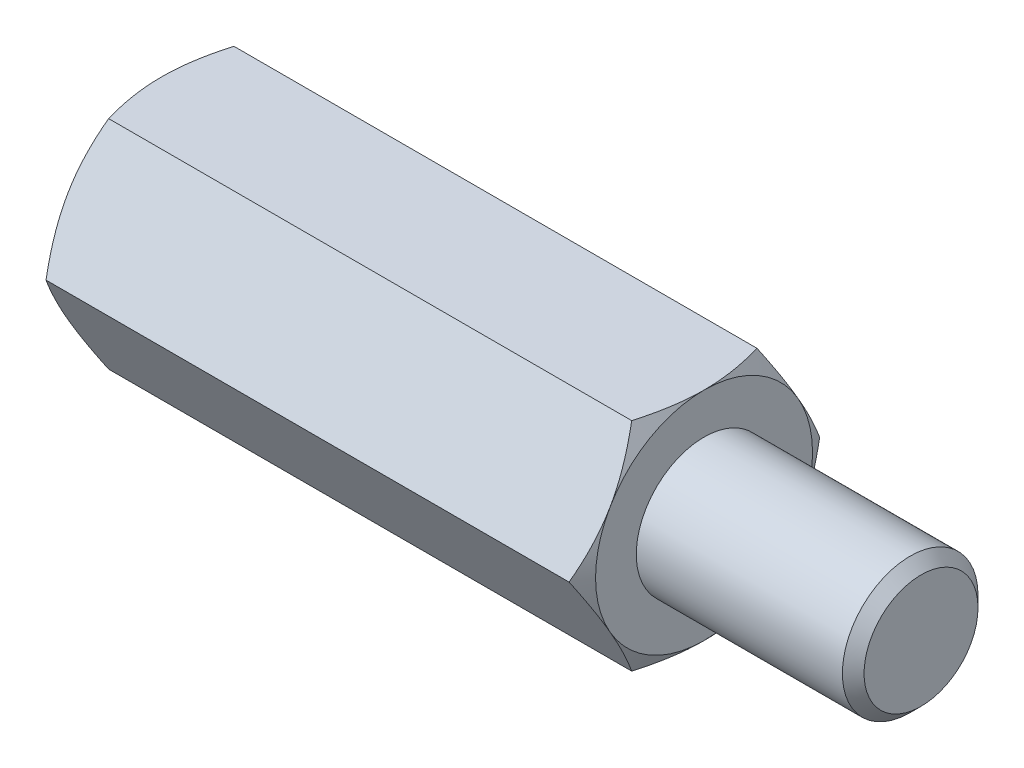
ISO-10303-21;
HEADER;
FILE_DESCRIPTION(('STEP AP214'),'2;1');
FILE_NAME('part.step','',(''),(''),'','','');
FILE_SCHEMA(('AUTOMOTIVE_DESIGN { 1 0 10303 214 1 1 1 1 }'));
ENDSEC;
DATA;
#1=APPLICATION_CONTEXT('core data for automotive mechanical design processes');
#2=APPLICATION_PROTOCOL_DEFINITION('international standard','automotive_design',2000,#1);
#3=PRODUCT_CONTEXT('',#1,'mechanical');
#4=PRODUCT('Part','Part','',(#3));
#5=PRODUCT_RELATED_PRODUCT_CATEGORY('part','',(#4));
#6=PRODUCT_DEFINITION_FORMATION('','',#4);
#7=PRODUCT_DEFINITION_CONTEXT('part definition',#1,'design');
#8=PRODUCT_DEFINITION('design','',#6,#7);
#9=PRODUCT_DEFINITION_SHAPE('','',#8);
#10=(LENGTH_UNIT() NAMED_UNIT(*) SI_UNIT(.MILLI.,.METRE.));
#11=(NAMED_UNIT(*) PLANE_ANGLE_UNIT() SI_UNIT($,.RADIAN.));
#12=(NAMED_UNIT(*) SI_UNIT($,.STERADIAN.) SOLID_ANGLE_UNIT());
#13=UNCERTAINTY_MEASURE_WITH_UNIT(LENGTH_MEASURE(1.E-05),#10,'distance_accuracy_value','');
#14=(GEOMETRIC_REPRESENTATION_CONTEXT(3) GLOBAL_UNCERTAINTY_ASSIGNED_CONTEXT((#13)) GLOBAL_UNIT_ASSIGNED_CONTEXT((#10,
#11,#12)) REPRESENTATION_CONTEXT('',''));
#15=CARTESIAN_POINT('',(0.,0.,0.));
#16=DIRECTION('',(0.,0.,1.));
#17=DIRECTION('',(1.,0.,0.));
#18=AXIS2_PLACEMENT_3D('',#15,#16,#17);
#19=CARTESIAN_POINT('',(10.,4.,-2.3094010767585));
#20=DIRECTION('',(1.,0.,0.));
#21=DIRECTION('',(0.,0.,-1.));
#22=AXIS2_PLACEMENT_3D('',#19,#20,#21);
#23=PLANE('',#22);
#24=CARTESIAN_POINT('',(10.,0.,0.));
#25=DIRECTION('',(1.,0.,0.));
#26=DIRECTION('',(0.,0.,-1.));
#27=AXIS2_PLACEMENT_3D('',#24,#25,#26);
#28=CIRCLE('',#27,4.);
#29=CARTESIAN_POINT('',(10.,-2.,-3.46410161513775));
#30=VERTEX_POINT('',#29);
#31=CARTESIAN_POINT('',(10.,2.,-3.46410161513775));
#32=VERTEX_POINT('',#31);
#33=EDGE_CURVE('E288',#30,#32,#28,.T.);
#34=ORIENTED_EDGE('',*,*,#33,.T.);
#35=CARTESIAN_POINT('',(10.,4.,0.));
#36=VERTEX_POINT('',#35);
#37=EDGE_CURVE('E53',#32,#36,#28,.T.);
#38=ORIENTED_EDGE('',*,*,#37,.T.);
#39=CARTESIAN_POINT('',(10.,2.,3.46410161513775));
#40=VERTEX_POINT('',#39);
#41=EDGE_CURVE('E297',#36,#40,#28,.T.);
#42=ORIENTED_EDGE('',*,*,#41,.T.);
#43=CARTESIAN_POINT('',(10.,-2.,3.46410161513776));
#44=VERTEX_POINT('',#43);
#45=EDGE_CURVE('E301',#40,#44,#28,.T.);
#46=ORIENTED_EDGE('',*,*,#45,.T.);
#47=CARTESIAN_POINT('',(10.,0.,0.));
#48=DIRECTION('',(-1.,0.,0.));
#49=DIRECTION('',(0.,-1.,0.));
#50=AXIS2_PLACEMENT_3D('',#47,#48,#49);
#51=CIRCLE('',#50,4.);
#52=CARTESIAN_POINT('',(10.,-4.,0.));
#53=VERTEX_POINT('',#52);
#54=EDGE_CURVE('E193',#53,#44,#51,.T.);
#55=ORIENTED_EDGE('',*,*,#54,.F.);
#56=EDGE_CURVE('E61',#53,#30,#28,.T.);
#57=ORIENTED_EDGE('',*,*,#56,.T.);
#58=EDGE_LOOP('',(#34,#38,#42,#46,#55,#57));
#59=FACE_BOUND('',#58,.T.);
#60=CARTESIAN_POINT('',(10.,0.,0.));
#61=DIRECTION('',(1.,0.,0.));
#62=DIRECTION('',(0.,0.,-1.));
#63=AXIS2_PLACEMENT_3D('',#60,#61,#62);
#64=CIRCLE('',#63,2.5);
#65=CARTESIAN_POINT('',(10.,0.,-2.5));
#66=VERTEX_POINT('',#65);
#67=EDGE_CURVE('E310',#66,#66,#64,.T.);
#68=ORIENTED_EDGE('',*,*,#67,.F.);
#69=EDGE_LOOP('',(#68));
#70=FACE_BOUND('',#69,.T.);
#71=ADVANCED_FACE('F37',(#59,#70),#23,.T.);
#72=CARTESIAN_POINT('',(10.,0.,-4.61880215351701));
#73=DIRECTION('',(0.,-0.5,0.866025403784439));
#74=DIRECTION('',(0.,-0.866025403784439,-0.5));
#75=AXIS2_PLACEMENT_3D('',#72,#73,#74);
#76=PLANE('',#75);
#77=CARTESIAN_POINT('',(9.64266774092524,-0.000200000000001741,-4.61891762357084));
#78=CARTESIAN_POINT('',(9.70128212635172,0.175579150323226,-4.5174314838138));
#79=CARTESIAN_POINT('',(9.75458967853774,0.352875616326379,-4.41506932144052));
#80=CARTESIAN_POINT('',(9.8476383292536,0.710538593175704,-4.2085725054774));
#81=CARTESIAN_POINT('',(9.8873465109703,0.890911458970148,-4.10443418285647));
#82=CARTESIAN_POINT('',(9.94915778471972,1.24942181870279,-3.89744813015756));
#83=CARTESIAN_POINT('',(9.97167226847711,1.42750415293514,-3.79463224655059));
#84=CARTESIAN_POINT('',(9.99854937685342,1.78450671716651,-3.58851671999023));
#85=CARTESIAN_POINT('',(10.0029342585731,1.9634256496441,-3.48521782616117));
#86=CARTESIAN_POINT('',(9.99380992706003,2.29774284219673,-3.29219970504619));
#87=CARTESIAN_POINT('',(9.98254104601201,2.45319115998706,-3.20245157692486));
#88=CARTESIAN_POINT('',(9.94682600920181,2.76307505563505,-3.02354002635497));
#89=CARTESIAN_POINT('',(9.92236765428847,2.91750956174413,-2.93437722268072));
#90=CARTESIAN_POINT('',(9.86122393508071,3.22803232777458,-2.75509682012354));
#91=CARTESIAN_POINT('',(9.82427939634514,3.3840812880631,-2.6650019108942));
#92=CARTESIAN_POINT('',(9.74042992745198,3.69385183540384,-2.48615580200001));
#93=CARTESIAN_POINT('',(9.69354469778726,3.84757739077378,-2.39740231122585));
#94=CARTESIAN_POINT('',(9.64266774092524,4.0002,-2.30928560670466));
#95=B_SPLINE_CURVE_WITH_KNOTS('',3,(#77,#78,#79,#80,#81,#82,#83,#84,#85,#86,#87,#88,#89,#90,#91,
#92,#93,#94),.UNSPECIFIED.,.F.,.F.,(4,2,2,2,2,2,2,2,4),(0.,0.634047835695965,1.26961969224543,
1.88946157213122,2.50854226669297,3.04757825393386,3.58711366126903,4.13861653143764,
4.68903648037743),.UNSPECIFIED.);
#96=CARTESIAN_POINT('',(9.64273441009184,0.,-4.61880215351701));
#97=VERTEX_POINT('',#96);
#98=EDGE_CURVE('E315',#97,#32,#95,.T.);
#99=ORIENTED_EDGE('',*,*,#98,.F.);
#100=DIRECTION('',(-1.,0.,0.));
#101=VECTOR('',#100,1.);
#102=CARTESIAN_POINT('',(10.,0.,-4.61880215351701));
#103=LINE('',#102,#101);
#104=CARTESIAN_POINT('',(-9.64273441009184,0.,-4.61880215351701));
#105=VERTEX_POINT('',#104);
#106=EDGE_CURVE('E264',#97,#105,#103,.T.);
#107=ORIENTED_EDGE('',*,*,#106,.T.);
#108=CARTESIAN_POINT('',(-9.64266774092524,4.0002,-2.30928560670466));
#109=CARTESIAN_POINT('',(-9.70128212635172,3.82442084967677,-2.4107717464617));
#110=CARTESIAN_POINT('',(-9.75458967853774,3.64712438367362,-2.51313390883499));
#111=CARTESIAN_POINT('',(-9.8476383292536,3.28946140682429,-2.71963072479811));
#112=CARTESIAN_POINT('',(-9.8873465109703,3.10908854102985,-2.82376904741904));
#113=CARTESIAN_POINT('',(-9.94915778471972,2.75057818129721,-3.03075510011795));
#114=CARTESIAN_POINT('',(-9.97167226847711,2.57249584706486,-3.13357098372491));
#115=CARTESIAN_POINT('',(-9.99854937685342,2.21549328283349,-3.33968651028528));
#116=CARTESIAN_POINT('',(-10.0029342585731,2.0365743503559,-3.44298540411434));
#117=CARTESIAN_POINT('',(-9.99380992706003,1.70225715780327,-3.63600352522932));
#118=CARTESIAN_POINT('',(-9.98254104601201,1.54680884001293,-3.72575165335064));
#119=CARTESIAN_POINT('',(-9.94682600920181,1.23692494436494,-3.90466320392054));
#120=CARTESIAN_POINT('',(-9.92236765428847,1.08249043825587,-3.99382600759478));
#121=CARTESIAN_POINT('',(-9.86122393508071,0.77196767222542,-4.17310641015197));
#122=CARTESIAN_POINT('',(-9.82427939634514,0.615918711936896,-4.26320131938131));
#123=CARTESIAN_POINT('',(-9.74042992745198,0.306148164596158,-4.4420474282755));
#124=CARTESIAN_POINT('',(-9.69354469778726,0.152422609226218,-4.53080091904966));
#125=CARTESIAN_POINT('',(-9.64266774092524,-0.000200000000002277,-4.61891762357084));
#126=B_SPLINE_CURVE_WITH_KNOTS('',3,(#108,#109,#110,#111,#112,#113,#114,#115,#116,#117,#118,
#119,#120,#121,#122,#123,#124,#125),.UNSPECIFIED.,.F.,.F.,(4,2,2,2,2,2,2,2,4),(0.,
0.634047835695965,1.26961969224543,1.88946157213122,2.50854226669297,3.04757825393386,
3.58711366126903,4.13861653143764,4.68903648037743),.UNSPECIFIED.);
#127=CARTESIAN_POINT('',(-10.,2.,-3.46410161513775));
#128=VERTEX_POINT('',#127);
#129=EDGE_CURVE('E318',#128,#105,#126,.T.);
#130=ORIENTED_EDGE('',*,*,#129,.F.);
#131=CARTESIAN_POINT('',(-9.64273441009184,4.,-2.3094010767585));
#132=VERTEX_POINT('',#131);
#133=EDGE_CURVE('E321',#132,#128,#126,.T.);
#134=ORIENTED_EDGE('',*,*,#133,.F.);
#135=DIRECTION('',(-1.,0.,0.));
#136=VECTOR('',#135,1.);
#137=CARTESIAN_POINT('',(10.,4.,-2.3094010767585));
#138=LINE('',#137,#136);
#139=CARTESIAN_POINT('',(9.64273441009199,4.,-2.30940107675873));
#140=VERTEX_POINT('',#139);
#141=EDGE_CURVE('E279',#140,#132,#138,.T.);
#142=ORIENTED_EDGE('',*,*,#141,.F.);
#143=EDGE_CURVE('E229',#32,#140,#95,.T.);
#144=ORIENTED_EDGE('',*,*,#143,.F.);
#145=EDGE_LOOP('',(#99,#107,#130,#134,#142,#144));
#146=FACE_BOUND('',#145,.T.);
#147=ADVANCED_FACE('F148',(#146),#76,.F.);
#148=CARTESIAN_POINT('',(10.,4.,-2.3094010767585));
#149=DIRECTION('',(0.,-1.,0.));
#150=DIRECTION('',(0.,0.,-1.));
#151=AXIS2_PLACEMENT_3D('',#148,#149,#150);
#152=PLANE('',#151);
#153=CARTESIAN_POINT('',(8.00829070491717,4.,-6.28479524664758));
#154=CARTESIAN_POINT('',(8.09370060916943,4.,-6.10939349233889));
#155=CARTESIAN_POINT('',(8.1783148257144,4.,-5.93359774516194));
#156=CARTESIAN_POINT('',(8.34550596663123,4.,-5.58100905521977));
#157=CARTESIAN_POINT('',(8.42808258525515,4.,-5.40421596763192));
#158=CARTESIAN_POINT('',(8.59115082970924,4.,-5.04855089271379));
#159=CARTESIAN_POINT('',(8.67162934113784,4.,-4.86967287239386));
#160=CARTESIAN_POINT('',(8.82940015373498,4.,-4.51052237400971));
#161=CARTESIAN_POINT('',(8.90669260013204,4.,-4.33024995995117));
#162=CARTESIAN_POINT('',(9.05980205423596,4.,-3.96189114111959));
#163=CARTESIAN_POINT('',(9.13548049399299,4.,-3.77374683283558));
#164=CARTESIAN_POINT('',(9.28130452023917,4.,-3.39528725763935));
#165=CARTESIAN_POINT('',(9.35144949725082,4.,-3.2049717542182));
#166=CARTESIAN_POINT('',(9.4844245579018,4.,-2.82219775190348));
#167=CARTESIAN_POINT('',(9.5472687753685,4.,-2.62974421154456));
#168=CARTESIAN_POINT('',(9.66367969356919,4.,-2.24207725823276));
#169=CARTESIAN_POINT('',(9.71724923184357,4.,-2.04686470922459));
#170=CARTESIAN_POINT('',(9.81230316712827,4.,-1.65467425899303));
#171=CARTESIAN_POINT('',(9.85385633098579,4.,-1.45771333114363));
#172=CARTESIAN_POINT('',(9.92259036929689,4.,-1.06125849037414));
#173=CARTESIAN_POINT('',(9.94977273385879,4.,-0.861764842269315));
#174=CARTESIAN_POINT('',(9.98724473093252,4.,-0.463879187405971));
#175=CARTESIAN_POINT('',(9.99775780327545,4.,-0.265508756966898));
#176=CARTESIAN_POINT('',(10.0015934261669,4.,0.131417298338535));
#177=CARTESIAN_POINT('',(9.99491584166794,4.,0.32997292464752));
#178=CARTESIAN_POINT('',(9.96964892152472,4.,0.664692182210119));
#179=CARTESIAN_POINT('',(9.95537089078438,4.,0.801202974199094));
#180=CARTESIAN_POINT('',(9.9195349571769,4.,1.07327201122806));
#181=CARTESIAN_POINT('',(9.89797613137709,4.,1.20883013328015));
#182=CARTESIAN_POINT('',(9.82350663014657,4.,1.61386939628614));
#183=CARTESIAN_POINT('',(9.76081499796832,4.,1.8815748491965));
#184=CARTESIAN_POINT('',(9.65151174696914,4.,2.28197262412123));
#185=CARTESIAN_POINT('',(9.61200931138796,4.,2.41672443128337));
#186=CARTESIAN_POINT('',(9.52875235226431,4.,2.6849206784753));
#187=CARTESIAN_POINT('',(9.4849977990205,4.,2.81836510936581));
#188=CARTESIAN_POINT('',(9.3939510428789,4.,3.08398596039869));
#189=CARTESIAN_POINT('',(9.34665989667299,4.,3.21616274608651));
#190=CARTESIAN_POINT('',(9.24911111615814,4.,3.47941134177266));
#191=CARTESIAN_POINT('',(9.1988535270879,4.,3.61048316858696));
#192=CARTESIAN_POINT('',(9.07132952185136,4.,3.93385125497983));
#193=CARTESIAN_POINT('',(8.9926014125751,4.,4.12557021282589));
#194=CARTESIAN_POINT('',(8.83096938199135,4.,4.50724553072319));
#195=CARTESIAN_POINT('',(8.74806513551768,4.,4.69720175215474));
#196=CARTESIAN_POINT('',(8.5789699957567,4.,5.07569950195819));
#197=CARTESIAN_POINT('',(8.49277827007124,4.,5.26424065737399));
#198=CARTESIAN_POINT('',(8.3178011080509,4.,5.64011758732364));
#199=CARTESIAN_POINT('',(8.22901560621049,4.,5.82745333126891));
#200=CARTESIAN_POINT('',(7.95934323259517,4.,6.38844423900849));
#201=CARTESIAN_POINT('',(7.77535618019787,4.,6.76060781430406));
#202=CARTESIAN_POINT('',(7.4019562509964,4.,7.50211228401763));
#203=CARTESIAN_POINT('',(7.2125442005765,4.,7.87145359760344));
#204=CARTESIAN_POINT('',(6.84738774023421,4.,8.57450173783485));
#205=CARTESIAN_POINT('',(6.67197556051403,4.,8.90838144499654));
#206=CARTESIAN_POINT('',(6.31880976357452,4.,9.57491712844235));
#207=CARTESIAN_POINT('',(6.14105604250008,4.,9.90757304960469));
#208=CARTESIAN_POINT('',(5.78429339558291,4.,10.5709822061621));
#209=CARTESIAN_POINT('',(5.60528952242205,3.99999999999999,10.9017381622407));
#210=CARTESIAN_POINT('',(5.24590712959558,3.99999999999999,11.5624752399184));
#211=CARTESIAN_POINT('',(5.06552869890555,3.99999999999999,11.8924564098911));
#212=CARTESIAN_POINT('',(4.88464248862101,3.99999999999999,12.2221569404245));
#213=B_SPLINE_CURVE_WITH_KNOTS('',3,(#153,#154,#155,#156,#157,#158,#159,#160,#161,#162,#163,
#164,#165,#166,#167,#168,#169,#170,#171,#172,#173,#174,#175,#176,#177,#178,#179,#180,#181,#182,
#183,#184,#185,#186,#187,#188,#189,#190,#191,#192,#193,#194,#195,#196,#197,#198,#199,#200,#201,
#202,#203,#204,#205,#206,#207,#208,#209,#210,#211,#212),.UNSPECIFIED.,.F.,.F.,(4,2,2,2,2,2,2,2,
2,2,2,2,2,2,2,2,2,2,2,2,2,2,2,2,2,2,2,2,2,4),(0.,0.58528075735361,1.17064881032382,
1.75906864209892,2.34746162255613,2.9557770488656,3.56415938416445,4.17134357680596,
4.77834167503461,5.38179402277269,5.98518378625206,6.58041501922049,7.17565092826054,
7.5872191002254,7.99883946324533,8.82250155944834,9.24373134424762,9.66496407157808,
10.086071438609,10.5071723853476,11.1288656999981,11.7506074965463,12.3725077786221,
12.9944237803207,14.2398211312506,15.4850297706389,16.6164791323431,17.7479788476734,
18.8762380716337,20.0044248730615),.UNSPECIFIED.);
#214=EDGE_CURVE('E227',#140,#36,#213,.T.);
#215=ORIENTED_EDGE('',*,*,#214,.F.);
#216=ORIENTED_EDGE('',*,*,#141,.T.);
#217=CARTESIAN_POINT('',(-8.00829070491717,4.,-6.28479524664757));
#218=CARTESIAN_POINT('',(-8.09370060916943,4.,-6.10939349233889));
#219=CARTESIAN_POINT('',(-8.1783148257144,4.,-5.93359774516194));
#220=CARTESIAN_POINT('',(-8.34550596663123,4.,-5.58100905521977));
#221=CARTESIAN_POINT('',(-8.42808258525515,4.,-5.40421596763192));
#222=CARTESIAN_POINT('',(-8.59115082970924,4.,-5.04855089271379));
#223=CARTESIAN_POINT('',(-8.67162934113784,4.,-4.86967287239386));
#224=CARTESIAN_POINT('',(-8.82940015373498,4.,-4.51052237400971));
#225=CARTESIAN_POINT('',(-8.90669260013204,4.,-4.33024995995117));
#226=CARTESIAN_POINT('',(-9.05980205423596,4.,-3.96189114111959));
#227=CARTESIAN_POINT('',(-9.135480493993,4.,-3.77374683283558));
#228=CARTESIAN_POINT('',(-9.28130452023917,4.,-3.39528725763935));
#229=CARTESIAN_POINT('',(-9.35144949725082,4.,-3.2049717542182));
#230=CARTESIAN_POINT('',(-9.4844245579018,4.,-2.82219775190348));
#231=CARTESIAN_POINT('',(-9.5472687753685,4.,-2.62974421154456));
#232=CARTESIAN_POINT('',(-9.66367969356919,4.,-2.24207725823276));
#233=CARTESIAN_POINT('',(-9.71724923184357,4.,-2.04686470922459));
#234=CARTESIAN_POINT('',(-9.81230316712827,4.,-1.65467425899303));
#235=CARTESIAN_POINT('',(-9.85385633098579,4.,-1.45771333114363));
#236=CARTESIAN_POINT('',(-9.92259036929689,4.,-1.06125849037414));
#237=CARTESIAN_POINT('',(-9.94977273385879,4.,-0.861764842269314));
#238=CARTESIAN_POINT('',(-9.98724473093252,4.,-0.46387918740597));
#239=CARTESIAN_POINT('',(-9.99775780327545,4.,-0.265508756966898));
#240=CARTESIAN_POINT('',(-10.0015934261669,4.,0.131417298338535));
#241=CARTESIAN_POINT('',(-9.99491584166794,4.,0.329972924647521));
#242=CARTESIAN_POINT('',(-9.96964892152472,4.,0.66469218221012));
#243=CARTESIAN_POINT('',(-9.95537089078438,4.,0.801202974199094));
#244=CARTESIAN_POINT('',(-9.9195349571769,4.,1.07327201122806));
#245=CARTESIAN_POINT('',(-9.89797613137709,4.,1.20883013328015));
#246=CARTESIAN_POINT('',(-9.82350663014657,4.,1.61386939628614));
#247=CARTESIAN_POINT('',(-9.76081499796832,4.,1.8815748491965));
#248=CARTESIAN_POINT('',(-9.65151174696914,4.,2.28197262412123));
#249=CARTESIAN_POINT('',(-9.61200931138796,4.,2.41672443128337));
#250=CARTESIAN_POINT('',(-9.52875235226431,4.,2.6849206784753));
#251=CARTESIAN_POINT('',(-9.48499779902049,4.,2.81836510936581));
#252=CARTESIAN_POINT('',(-9.3939510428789,4.,3.08398596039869));
#253=CARTESIAN_POINT('',(-9.34665989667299,4.,3.21616274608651));
#254=CARTESIAN_POINT('',(-9.24911111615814,4.,3.47941134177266));
#255=CARTESIAN_POINT('',(-9.1988535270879,4.,3.61048316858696));
#256=CARTESIAN_POINT('',(-9.07132952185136,4.,3.93385125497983));
#257=CARTESIAN_POINT('',(-8.9926014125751,4.,4.12557021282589));
#258=CARTESIAN_POINT('',(-8.83096938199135,4.,4.50724553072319));
#259=CARTESIAN_POINT('',(-8.74806513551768,4.,4.69720175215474));
#260=CARTESIAN_POINT('',(-8.5789699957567,4.,5.07569950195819));
#261=CARTESIAN_POINT('',(-8.49277827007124,4.,5.26424065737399));
#262=CARTESIAN_POINT('',(-8.3178011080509,4.,5.64011758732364));
#263=CARTESIAN_POINT('',(-8.22901560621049,4.,5.8274533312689));
#264=CARTESIAN_POINT('',(-7.95934323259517,4.,6.38844423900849));
#265=CARTESIAN_POINT('',(-7.77535618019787,4.,6.76060781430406));
#266=CARTESIAN_POINT('',(-7.4019562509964,4.,7.50211228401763));
#267=CARTESIAN_POINT('',(-7.2125442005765,4.,7.87145359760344));
#268=CARTESIAN_POINT('',(-6.84738774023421,4.,8.57450173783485));
#269=CARTESIAN_POINT('',(-6.67197556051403,4.,8.90838144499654));
#270=CARTESIAN_POINT('',(-6.31880976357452,4.,9.57491712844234));
#271=CARTESIAN_POINT('',(-6.14105604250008,4.,9.90757304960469));
#272=CARTESIAN_POINT('',(-5.78429339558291,4.,10.5709822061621));
#273=CARTESIAN_POINT('',(-5.60528952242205,3.99999999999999,10.9017381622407));
#274=CARTESIAN_POINT('',(-5.24590712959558,3.99999999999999,11.5624752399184));
#275=CARTESIAN_POINT('',(-5.06552869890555,3.99999999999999,11.8924564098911));
#276=CARTESIAN_POINT('',(-4.88464248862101,3.99999999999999,12.2221569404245));
#277=B_SPLINE_CURVE_WITH_KNOTS('',3,(#217,#218,#219,#220,#221,#222,#223,#224,#225,#226,#227,
#228,#229,#230,#231,#232,#233,#234,#235,#236,#237,#238,#239,#240,#241,#242,#243,#244,#245,#246,
#247,#248,#249,#250,#251,#252,#253,#254,#255,#256,#257,#258,#259,#260,#261,#262,#263,#264,#265,
#266,#267,#268,#269,#270,#271,#272,#273,#274,#275,#276),.UNSPECIFIED.,.F.,.F.,(4,2,2,2,2,2,2,2,
2,2,2,2,2,2,2,2,2,2,2,2,2,2,2,2,2,2,2,2,2,4),(0.,0.585280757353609,1.17064881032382,
1.75906864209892,2.34746162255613,2.9557770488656,3.56415938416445,4.17134357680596,
4.77834167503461,5.38179402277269,5.98518378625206,6.58041501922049,7.17565092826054,
7.5872191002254,7.99883946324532,8.82250155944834,9.24373134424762,9.66496407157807,
10.086071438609,10.5071723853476,11.1288656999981,11.7506074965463,12.3725077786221,
12.9944237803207,14.2398211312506,15.4850297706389,16.6164791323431,17.7479788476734,
18.8762380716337,20.0044248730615),.UNSPECIFIED.);
#278=CARTESIAN_POINT('',(-10.,4.,0.));
#279=VERTEX_POINT('',#278);
#280=EDGE_CURVE('E241',#279,#132,#277,.F.);
#281=ORIENTED_EDGE('',*,*,#280,.F.);
#282=CARTESIAN_POINT('',(-9.64273441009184,4.,2.3094010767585));
#283=VERTEX_POINT('',#282);
#284=EDGE_CURVE('E249',#283,#279,#277,.F.);
#285=ORIENTED_EDGE('',*,*,#284,.F.);
#286=DIRECTION('',(-1.,0.,0.));
#287=VECTOR('',#286,1.);
#288=CARTESIAN_POINT('',(10.,4.,2.3094010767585));
#289=LINE('',#288,#287);
#290=CARTESIAN_POINT('',(9.64273441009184,4.,2.3094010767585));
#291=VERTEX_POINT('',#290);
#292=EDGE_CURVE('E276',#291,#283,#289,.T.);
#293=ORIENTED_EDGE('',*,*,#292,.F.);
#294=EDGE_CURVE('E221',#36,#291,#213,.T.);
#295=ORIENTED_EDGE('',*,*,#294,.F.);
#296=EDGE_LOOP('',(#215,#216,#281,#285,#293,#295));
#297=FACE_BOUND('',#296,.T.);
#298=ADVANCED_FACE('F153',(#297),#152,.F.);
#299=CARTESIAN_POINT('',(10.,4.,2.3094010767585));
#300=DIRECTION('',(0.,-0.5,-0.866025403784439));
#301=DIRECTION('',(0.,0.866025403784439,-0.5));
#302=AXIS2_PLACEMENT_3D('',#299,#300,#301);
#303=PLANE('',#302);
#304=CARTESIAN_POINT('',(9.64266774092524,4.0002,2.30928560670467));
#305=CARTESIAN_POINT('',(9.70128212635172,3.82442084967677,2.4107717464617));
#306=CARTESIAN_POINT('',(9.75458967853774,3.64712438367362,2.51313390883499));
#307=CARTESIAN_POINT('',(9.8476383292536,3.28946140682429,2.71963072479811));
#308=CARTESIAN_POINT('',(9.8873465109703,3.10908854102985,2.82376904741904));
#309=CARTESIAN_POINT('',(9.94915778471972,2.75057818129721,3.03075510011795));
#310=CARTESIAN_POINT('',(9.97167226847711,2.57249584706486,3.13357098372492));
#311=CARTESIAN_POINT('',(9.99854937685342,2.21549328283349,3.33968651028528));
#312=CARTESIAN_POINT('',(10.0029342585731,2.0365743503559,3.44298540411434));
#313=CARTESIAN_POINT('',(9.99380992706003,1.70225715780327,3.63600352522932));
#314=CARTESIAN_POINT('',(9.98254104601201,1.54680884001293,3.72575165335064));
#315=CARTESIAN_POINT('',(9.94682600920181,1.23692494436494,3.90466320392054));
#316=CARTESIAN_POINT('',(9.92236765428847,1.08249043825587,3.99382600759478));
#317=CARTESIAN_POINT('',(9.86122393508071,0.771967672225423,4.17310641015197));
#318=CARTESIAN_POINT('',(9.82427939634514,0.615918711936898,4.26320131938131));
#319=CARTESIAN_POINT('',(9.74042992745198,0.306148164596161,4.4420474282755));
#320=CARTESIAN_POINT('',(9.69354469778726,0.152422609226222,4.53080091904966));
#321=CARTESIAN_POINT('',(9.64266774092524,-0.000199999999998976,4.61891762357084));
#322=B_SPLINE_CURVE_WITH_KNOTS('',3,(#304,#305,#306,#307,#308,#309,#310,#311,#312,#313,#314,
#315,#316,#317,#318,#319,#320,#321),.UNSPECIFIED.,.F.,.F.,(4,2,2,2,2,2,2,2,4),(0.,
0.634047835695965,1.26961969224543,1.88946157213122,2.50854226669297,3.04757825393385,
3.58711366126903,4.13861653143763,4.68903648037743),.UNSPECIFIED.);
#323=EDGE_CURVE('E228',#291,#40,#322,.T.);
#324=ORIENTED_EDGE('',*,*,#323,.F.);
#325=ORIENTED_EDGE('',*,*,#292,.T.);
#326=CARTESIAN_POINT('',(-9.64266774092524,-0.000199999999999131,4.61891762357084));
#327=CARTESIAN_POINT('',(-9.70128212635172,0.175579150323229,4.5174314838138));
#328=CARTESIAN_POINT('',(-9.75458967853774,0.352875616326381,4.41506932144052));
#329=CARTESIAN_POINT('',(-9.8476383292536,0.710538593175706,4.20857250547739));
#330=CARTESIAN_POINT('',(-9.8873465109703,0.890911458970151,4.10443418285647));
#331=CARTESIAN_POINT('',(-9.94915778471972,1.24942181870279,3.89744813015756));
#332=CARTESIAN_POINT('',(-9.97167226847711,1.42750415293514,3.79463224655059));
#333=CARTESIAN_POINT('',(-9.99854937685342,1.78450671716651,3.58851671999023));
#334=CARTESIAN_POINT('',(-10.0029342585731,1.9634256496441,3.48521782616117));
#335=CARTESIAN_POINT('',(-9.99380992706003,2.29774284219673,3.29219970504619));
#336=CARTESIAN_POINT('',(-9.98254104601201,2.45319115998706,3.20245157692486));
#337=CARTESIAN_POINT('',(-9.94682600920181,2.76307505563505,3.02354002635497));
#338=CARTESIAN_POINT('',(-9.92236765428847,2.91750956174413,2.93437722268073));
#339=CARTESIAN_POINT('',(-9.86122393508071,3.22803232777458,2.75509682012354));
#340=CARTESIAN_POINT('',(-9.82427939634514,3.3840812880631,2.6650019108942));
#341=CARTESIAN_POINT('',(-9.74042992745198,3.69385183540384,2.48615580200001));
#342=CARTESIAN_POINT('',(-9.69354469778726,3.84757739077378,2.39740231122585));
#343=CARTESIAN_POINT('',(-9.64266774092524,4.0002,2.30928560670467));
#344=B_SPLINE_CURVE_WITH_KNOTS('',3,(#326,#327,#328,#329,#330,#331,#332,#333,#334,#335,#336,
#337,#338,#339,#340,#341,#342,#343),.UNSPECIFIED.,.F.,.F.,(4,2,2,2,2,2,2,2,4),(0.,
0.634047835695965,1.26961969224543,1.88946157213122,2.50854226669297,3.04757825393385,
3.58711366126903,4.13861653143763,4.68903648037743),.UNSPECIFIED.);
#345=CARTESIAN_POINT('',(-10.,2.,3.46410161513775));
#346=VERTEX_POINT('',#345);
#347=EDGE_CURVE('E255',#346,#283,#344,.T.);
#348=ORIENTED_EDGE('',*,*,#347,.F.);
#349=CARTESIAN_POINT('',(-9.64273441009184,0.,4.618802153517));
#350=VERTEX_POINT('',#349);
#351=EDGE_CURVE('E262',#350,#346,#344,.T.);
#352=ORIENTED_EDGE('',*,*,#351,.F.);
#353=DIRECTION('',(-1.,0.,0.));
#354=VECTOR('',#353,1.);
#355=CARTESIAN_POINT('',(10.,0.,4.618802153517));
#356=LINE('',#355,#354);
#357=CARTESIAN_POINT('',(9.64273441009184,0.,4.618802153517));
#358=VERTEX_POINT('',#357);
#359=EDGE_CURVE('E273',#358,#350,#356,.T.);
#360=ORIENTED_EDGE('',*,*,#359,.F.);
#361=EDGE_CURVE('E215',#40,#358,#322,.T.);
#362=ORIENTED_EDGE('',*,*,#361,.F.);
#363=EDGE_LOOP('',(#324,#325,#348,#352,#360,#362));
#364=FACE_BOUND('',#363,.T.);
#365=ADVANCED_FACE('F235',(#364),#303,.F.);
#366=CARTESIAN_POINT('',(10.,0.,4.618802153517));
#367=DIRECTION('',(0.,0.5,-0.866025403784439));
#368=DIRECTION('',(0.,0.866025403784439,0.5));
#369=AXIS2_PLACEMENT_3D('',#366,#367,#368);
#370=PLANE('',#369);
#371=CARTESIAN_POINT('',(9.64266774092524,0.000200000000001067,4.61891762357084));
#372=CARTESIAN_POINT('',(9.70128212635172,-0.175579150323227,4.5174314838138));
#373=CARTESIAN_POINT('',(9.75458967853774,-0.352875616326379,4.41506932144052));
#374=CARTESIAN_POINT('',(9.8476383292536,-0.710538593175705,4.20857250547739));
#375=CARTESIAN_POINT('',(9.8873465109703,-0.890911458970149,4.10443418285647));
#376=CARTESIAN_POINT('',(9.94915778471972,-1.24942181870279,3.89744813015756));
#377=CARTESIAN_POINT('',(9.97167226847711,-1.42750415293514,3.79463224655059));
#378=CARTESIAN_POINT('',(9.99854937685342,-1.78450671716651,3.58851671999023));
#379=CARTESIAN_POINT('',(10.0029342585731,-1.9634256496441,3.48521782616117));
#380=CARTESIAN_POINT('',(9.99380992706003,-2.29774284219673,3.29219970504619));
#381=CARTESIAN_POINT('',(9.98254104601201,-2.45319115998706,3.20245157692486));
#382=CARTESIAN_POINT('',(9.94682600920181,-2.76307505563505,3.02354002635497));
#383=CARTESIAN_POINT('',(9.92236765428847,-2.91750956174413,2.93437722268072));
#384=CARTESIAN_POINT('',(9.86122393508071,-3.22803232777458,2.75509682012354));
#385=CARTESIAN_POINT('',(9.82427939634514,-3.3840812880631,2.6650019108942));
#386=CARTESIAN_POINT('',(9.74042992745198,-3.69385183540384,2.48615580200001));
#387=CARTESIAN_POINT('',(9.69354469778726,-3.84757739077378,2.39740231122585));
#388=CARTESIAN_POINT('',(9.64266774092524,-4.0002,2.30928560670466));
#389=B_SPLINE_CURVE_WITH_KNOTS('',3,(#371,#372,#373,#374,#375,#376,#377,#378,#379,#380,#381,
#382,#383,#384,#385,#386,#387,#388),.UNSPECIFIED.,.F.,.F.,(4,2,2,2,2,2,2,2,4),(0.,
0.634047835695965,1.26961969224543,1.88946157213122,2.50854226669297,3.04757825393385,
3.58711366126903,4.13861653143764,4.68903648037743),.UNSPECIFIED.);
#390=EDGE_CURVE('E375',#358,#44,#389,.T.);
#391=ORIENTED_EDGE('',*,*,#390,.F.);
#392=ORIENTED_EDGE('',*,*,#359,.T.);
#393=CARTESIAN_POINT('',(-9.64266774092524,-4.0002,2.30928560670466));
#394=CARTESIAN_POINT('',(-9.70128212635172,-3.82442084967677,2.4107717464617));
#395=CARTESIAN_POINT('',(-9.75458967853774,-3.64712438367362,2.51313390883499));
#396=CARTESIAN_POINT('',(-9.8476383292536,-3.28946140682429,2.71963072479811));
#397=CARTESIAN_POINT('',(-9.8873465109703,-3.10908854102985,2.82376904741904));
#398=CARTESIAN_POINT('',(-9.94915778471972,-2.75057818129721,3.03075510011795));
#399=CARTESIAN_POINT('',(-9.97167226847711,-2.57249584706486,3.13357098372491));
#400=CARTESIAN_POINT('',(-9.99854937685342,-2.21549328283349,3.33968651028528));
#401=CARTESIAN_POINT('',(-10.0029342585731,-2.0365743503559,3.44298540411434));
#402=CARTESIAN_POINT('',(-9.99380992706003,-1.70225715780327,3.63600352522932));
#403=CARTESIAN_POINT('',(-9.98254104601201,-1.54680884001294,3.72575165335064));
#404=CARTESIAN_POINT('',(-9.94682600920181,-1.23692494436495,3.90466320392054));
#405=CARTESIAN_POINT('',(-9.92236765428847,-1.08249043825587,3.99382600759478));
#406=CARTESIAN_POINT('',(-9.86122393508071,-0.771967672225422,4.17310641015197));
#407=CARTESIAN_POINT('',(-9.82427939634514,-0.615918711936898,4.26320131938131));
#408=CARTESIAN_POINT('',(-9.74042992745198,-0.30614816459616,4.4420474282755));
#409=CARTESIAN_POINT('',(-9.69354469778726,-0.15242260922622,4.53080091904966));
#410=CARTESIAN_POINT('',(-9.64266774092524,0.000200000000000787,4.61891762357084));
#411=B_SPLINE_CURVE_WITH_KNOTS('',3,(#393,#394,#395,#396,#397,#398,#399,#400,#401,#402,#403,
#404,#405,#406,#407,#408,#409,#410),.UNSPECIFIED.,.F.,.F.,(4,2,2,2,2,2,2,2,4),(0.,
0.634047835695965,1.26961969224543,1.88946157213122,2.50854226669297,3.04757825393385,
3.58711366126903,4.13861653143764,4.68903648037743),.UNSPECIFIED.);
#412=CARTESIAN_POINT('',(-10.,-2.,3.46410161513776));
#413=VERTEX_POINT('',#412);
#414=EDGE_CURVE('E263',#413,#350,#411,.T.);
#415=ORIENTED_EDGE('',*,*,#414,.F.);
#416=CARTESIAN_POINT('',(-9.64273441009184,-4.,2.3094010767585));
#417=VERTEX_POINT('',#416);
#418=EDGE_CURVE('E250',#417,#413,#411,.T.);
#419=ORIENTED_EDGE('',*,*,#418,.F.);
#420=DIRECTION('',(-1.,0.,0.));
#421=VECTOR('',#420,1.);
#422=CARTESIAN_POINT('',(10.,-4.,2.3094010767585));
#423=LINE('',#422,#421);
#424=CARTESIAN_POINT('',(9.64273441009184,-4.,2.3094010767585));
#425=VERTEX_POINT('',#424);
#426=EDGE_CURVE('E270',#425,#417,#423,.T.);
#427=ORIENTED_EDGE('',*,*,#426,.F.);
#428=EDGE_CURVE('E210',#44,#425,#389,.T.);
#429=ORIENTED_EDGE('',*,*,#428,.F.);
#430=EDGE_LOOP('',(#391,#392,#415,#419,#427,#429));
#431=FACE_BOUND('',#430,.T.);
#432=ADVANCED_FACE('F372',(#431),#370,.F.);
#433=CARTESIAN_POINT('',(10.,-4.,2.3094010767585));
#434=DIRECTION('',(0.,1.,0.));
#435=DIRECTION('',(0.,0.,1.));
#436=AXIS2_PLACEMENT_3D('',#433,#434,#435);
#437=PLANE('',#436);
#438=CARTESIAN_POINT('',(8.0082907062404,-4.,-6.28479524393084));
#439=CARTESIAN_POINT('',(8.09370061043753,-4.,-6.10939348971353));
#440=CARTESIAN_POINT('',(8.17831482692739,-4.,-5.93359774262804));
#441=CARTESIAN_POINT('',(8.34550596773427,-4.,-5.58100905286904));
#442=CARTESIAN_POINT('',(8.42808258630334,-4.,-5.40421596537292));
#443=CARTESIAN_POINT('',(8.59115083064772,-4.,-5.04855089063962));
#444=CARTESIAN_POINT('',(8.67162934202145,-4.,-4.86967287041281));
#445=CARTESIAN_POINT('',(8.82940015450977,-4.,-4.51052237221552));
#446=CARTESIAN_POINT('',(8.90669260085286,-4.,-4.33024995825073));
#447=CARTESIAN_POINT('',(9.05980205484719,-4.,-3.96189113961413));
#448=CARTESIAN_POINT('',(9.13548049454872,-4.,-3.77374683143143));
#449=CARTESIAN_POINT('',(9.28130452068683,-4.,-3.39528725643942));
#450=CARTESIAN_POINT('',(9.35144949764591,-4.,-3.2049717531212));
#451=CARTESIAN_POINT('',(9.48442455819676,-4.,-2.82219775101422));
#452=CARTESIAN_POINT('',(9.54726877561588,-4.,-2.62974421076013));
#453=CARTESIAN_POINT('',(9.66367969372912,-4.,-2.24207725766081));
#454=CARTESIAN_POINT('',(9.71724923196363,-4.,-2.04686470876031));
#455=CARTESIAN_POINT('',(9.81230316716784,-4.,-1.65467425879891));
#456=CARTESIAN_POINT('',(9.85385633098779,-4.,-1.45771333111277));
#457=CARTESIAN_POINT('',(9.9225903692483,-4.,-1.06125849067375));
#458=CARTESIAN_POINT('',(9.94977273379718,-4.,-0.861764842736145));
#459=CARTESIAN_POINT('',(9.98724473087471,-4.,-0.463879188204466));
#460=CARTESIAN_POINT('',(9.99775780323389,-4.,-0.265508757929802));
#461=CARTESIAN_POINT('',(10.0015934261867,-4.,0.131417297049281));
#462=CARTESIAN_POINT('',(9.99491584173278,-4.,0.329972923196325));
#463=CARTESIAN_POINT('',(9.96964892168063,-4.,0.664692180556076));
#464=CARTESIAN_POINT('',(9.95537089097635,-4.,0.801202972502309));
#465=CARTESIAN_POINT('',(9.91953495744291,-4.,1.07327200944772));
#466=CARTESIAN_POINT('',(9.89797613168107,-4.,1.20883013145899));
#467=CARTESIAN_POINT('',(9.82350663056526,-4.,1.6138693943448));
#468=CARTESIAN_POINT('',(9.76081499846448,-4.,1.88157484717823));
#469=CARTESIAN_POINT('',(9.65151174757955,-4.,2.28197262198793));
#470=CARTESIAN_POINT('',(9.6120093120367,-4.,2.41672442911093));
#471=CARTESIAN_POINT('',(9.52875235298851,-4.,2.68492067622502));
#472=CARTESIAN_POINT('',(9.48499779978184,-4.,2.81836510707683));
#473=CARTESIAN_POINT('',(9.39395104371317,-4.,3.08398595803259));
#474=CARTESIAN_POINT('',(9.34665989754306,-4.,3.216162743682));
#475=CARTESIAN_POINT('',(9.24911111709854,-4.,3.47941133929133));
#476=CARTESIAN_POINT('',(9.19885352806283,-4.,3.61048316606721));
#477=CARTESIAN_POINT('',(9.07132952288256,-4.,3.93385125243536));
#478=CARTESIAN_POINT('',(8.99260141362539,-4.,4.12557021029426));
#479=CARTESIAN_POINT('',(8.830969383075,-4.,4.50724552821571));
#480=CARTESIAN_POINT('',(8.74806513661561,-4.,4.69720174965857));
#481=CARTESIAN_POINT('',(8.57896999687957,-4.,5.07569949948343));
#482=CARTESIAN_POINT('',(8.49277827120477,-4.,5.26424065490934));
#483=CARTESIAN_POINT('',(8.31780110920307,-4.,5.64011758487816));
#484=CARTESIAN_POINT('',(8.22901560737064,-4.,5.82745332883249));
#485=CARTESIAN_POINT('',(7.95934323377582,-4.,6.38844423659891));
#486=CARTESIAN_POINT('',(7.77535618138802,-4.,6.76060781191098));
#487=CARTESIAN_POINT('',(7.40195625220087,-4.,7.50211228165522));
#488=CARTESIAN_POINT('',(7.2125442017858,-4.,7.8714535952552));
#489=CARTESIAN_POINT('',(6.84738774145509,-4.,8.57450173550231));
#490=CARTESIAN_POINT('',(6.67197556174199,-4.,8.90838144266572));
#491=CARTESIAN_POINT('',(6.3188097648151,-4.,9.57491712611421));
#492=CARTESIAN_POINT('',(6.14105604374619,-4.,9.90757304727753));
#493=CARTESIAN_POINT('',(5.78429339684,-4.,10.5709822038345));
#494=CARTESIAN_POINT('',(5.60528952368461,-4.,10.9017381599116));
#495=CARTESIAN_POINT('',(5.24590713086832,-4.,11.562475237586));
#496=CARTESIAN_POINT('',(5.06552870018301,-4.,11.8924564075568));
#497=CARTESIAN_POINT('',(4.88464248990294,-4.,12.2221569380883));
#498=B_SPLINE_CURVE_WITH_KNOTS('',3,(#438,#439,#440,#441,#442,#443,#444,#445,#446,#447,#448,
#449,#450,#451,#452,#453,#454,#455,#456,#457,#458,#459,#460,#461,#462,#463,#464,#465,#466,#467,
#468,#469,#470,#471,#472,#473,#474,#475,#476,#477,#478,#479,#480,#481,#482,#483,#484,#485,#486,
#487,#488,#489,#490,#491,#492,#493,#494,#495,#496,#497),.UNSPECIFIED.,.F.,.F.,(4,2,2,2,2,2,2,2,
2,2,2,2,2,2,2,2,2,2,2,2,2,2,2,2,2,2,2,2,2,4),(0.,0.585280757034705,1.17064880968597,
1.75906864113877,2.34746162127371,2.95577704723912,3.56415938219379,4.17134357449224,
4.7783416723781,5.38179401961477,5.98518378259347,6.58041501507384,7.1756509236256,
7.5872190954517,7.99883945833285,8.82250155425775,9.24373133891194,9.66496406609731,
10.0860714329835,10.5071723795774,11.1288656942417,11.7506074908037,12.3725077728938,
12.9944237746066,14.2398211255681,15.4850297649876,16.6164791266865,17.7479788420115,
18.8762380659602,20.0044248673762),.UNSPECIFIED.);
#499=EDGE_CURVE('E383',#425,#53,#498,.F.);
#500=ORIENTED_EDGE('',*,*,#499,.F.);
#501=ORIENTED_EDGE('',*,*,#426,.T.);
#502=CARTESIAN_POINT('',(-8.0082907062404,-4.,-6.28479524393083));
#503=CARTESIAN_POINT('',(-8.09370061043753,-4.,-6.10939348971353));
#504=CARTESIAN_POINT('',(-8.17831482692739,-4.,-5.93359774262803));
#505=CARTESIAN_POINT('',(-8.34550596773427,-4.,-5.58100905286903));
#506=CARTESIAN_POINT('',(-8.42808258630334,-4.,-5.40421596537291));
#507=CARTESIAN_POINT('',(-8.59115083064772,-4.,-5.04855089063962));
#508=CARTESIAN_POINT('',(-8.67162934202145,-4.,-4.86967287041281));
#509=CARTESIAN_POINT('',(-8.82940015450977,-4.,-4.51052237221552));
#510=CARTESIAN_POINT('',(-8.90669260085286,-4.,-4.33024995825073));
#511=CARTESIAN_POINT('',(-9.05980205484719,-4.,-3.96189113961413));
#512=CARTESIAN_POINT('',(-9.13548049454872,-4.,-3.77374683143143));
#513=CARTESIAN_POINT('',(-9.28130452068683,-4.,-3.39528725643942));
#514=CARTESIAN_POINT('',(-9.35144949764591,-4.,-3.2049717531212));
#515=CARTESIAN_POINT('',(-9.48442455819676,-4.,-2.82219775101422));
#516=CARTESIAN_POINT('',(-9.54726877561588,-4.,-2.62974421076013));
#517=CARTESIAN_POINT('',(-9.66367969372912,-4.,-2.24207725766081));
#518=CARTESIAN_POINT('',(-9.71724923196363,-4.,-2.04686470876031));
#519=CARTESIAN_POINT('',(-9.81230316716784,-4.,-1.65467425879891));
#520=CARTESIAN_POINT('',(-9.85385633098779,-4.,-1.45771333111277));
#521=CARTESIAN_POINT('',(-9.9225903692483,-4.,-1.06125849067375));
#522=CARTESIAN_POINT('',(-9.94977273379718,-4.,-0.861764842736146));
#523=CARTESIAN_POINT('',(-9.98724473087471,-4.,-0.463879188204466));
#524=CARTESIAN_POINT('',(-9.99775780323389,-4.,-0.265508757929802));
#525=CARTESIAN_POINT('',(-10.0015934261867,-4.,0.131417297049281));
#526=CARTESIAN_POINT('',(-9.99491584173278,-4.,0.329972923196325));
#527=CARTESIAN_POINT('',(-9.96964892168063,-4.,0.664692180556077));
#528=CARTESIAN_POINT('',(-9.95537089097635,-4.,0.80120297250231));
#529=CARTESIAN_POINT('',(-9.9195349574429,-4.,1.07327200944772));
#530=CARTESIAN_POINT('',(-9.89797613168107,-4.,1.20883013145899));
#531=CARTESIAN_POINT('',(-9.82350663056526,-4.,1.6138693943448));
#532=CARTESIAN_POINT('',(-9.76081499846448,-4.,1.88157484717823));
#533=CARTESIAN_POINT('',(-9.65151174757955,-4.,2.28197262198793));
#534=CARTESIAN_POINT('',(-9.6120093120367,-4.,2.41672442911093));
#535=CARTESIAN_POINT('',(-9.52875235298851,-4.,2.68492067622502));
#536=CARTESIAN_POINT('',(-9.48499779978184,-4.,2.81836510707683));
#537=CARTESIAN_POINT('',(-9.39395104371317,-4.,3.08398595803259));
#538=CARTESIAN_POINT('',(-9.34665989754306,-4.,3.216162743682));
#539=CARTESIAN_POINT('',(-9.24911111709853,-4.,3.47941133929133));
#540=CARTESIAN_POINT('',(-9.19885352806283,-4.,3.61048316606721));
#541=CARTESIAN_POINT('',(-9.07132952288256,-4.,3.93385125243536));
#542=CARTESIAN_POINT('',(-8.99260141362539,-4.,4.12557021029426));
#543=CARTESIAN_POINT('',(-8.830969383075,-4.,4.50724552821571));
#544=CARTESIAN_POINT('',(-8.74806513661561,-4.,4.69720174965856));
#545=CARTESIAN_POINT('',(-8.57896999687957,-4.,5.07569949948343));
#546=CARTESIAN_POINT('',(-8.49277827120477,-4.,5.26424065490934));
#547=CARTESIAN_POINT('',(-8.31780110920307,-4.,5.64011758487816));
#548=CARTESIAN_POINT('',(-8.22901560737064,-4.,5.82745332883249));
#549=CARTESIAN_POINT('',(-7.95934323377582,-4.,6.38844423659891));
#550=CARTESIAN_POINT('',(-7.77535618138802,-4.,6.76060781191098));
#551=CARTESIAN_POINT('',(-7.40195625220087,-4.,7.50211228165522));
#552=CARTESIAN_POINT('',(-7.2125442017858,-4.,7.87145359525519));
#553=CARTESIAN_POINT('',(-6.84738774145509,-4.,8.57450173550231));
#554=CARTESIAN_POINT('',(-6.671975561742,-4.,8.90838144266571));
#555=CARTESIAN_POINT('',(-6.3188097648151,-4.,9.5749171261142));
#556=CARTESIAN_POINT('',(-6.1410560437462,-4.,9.90757304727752));
#557=CARTESIAN_POINT('',(-5.78429339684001,-4.,10.5709822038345));
#558=CARTESIAN_POINT('',(-5.60528952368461,-4.,10.9017381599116));
#559=CARTESIAN_POINT('',(-5.24590713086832,-4.,11.562475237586));
#560=CARTESIAN_POINT('',(-5.06552870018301,-4.,11.8924564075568));
#561=CARTESIAN_POINT('',(-4.88464248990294,-4.,12.2221569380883));
#562=B_SPLINE_CURVE_WITH_KNOTS('',3,(#502,#503,#504,#505,#506,#507,#508,#509,#510,#511,#512,
#513,#514,#515,#516,#517,#518,#519,#520,#521,#522,#523,#524,#525,#526,#527,#528,#529,#530,#531,
#532,#533,#534,#535,#536,#537,#538,#539,#540,#541,#542,#543,#544,#545,#546,#547,#548,#549,#550,
#551,#552,#553,#554,#555,#556,#557,#558,#559,#560,#561),.UNSPECIFIED.,.F.,.F.,(4,2,2,2,2,2,2,2,
2,2,2,2,2,2,2,2,2,2,2,2,2,2,2,2,2,2,2,2,2,4),(0.,0.585280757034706,1.17064880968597,
1.75906864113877,2.34746162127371,2.95577704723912,3.56415938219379,4.17134357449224,
4.7783416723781,5.38179401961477,5.98518378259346,6.58041501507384,7.1756509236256,
7.5872190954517,7.99883945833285,8.82250155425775,9.24373133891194,9.66496406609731,
10.0860714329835,10.5071723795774,11.1288656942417,11.7506074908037,12.3725077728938,
12.9944237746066,14.2398211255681,15.4850297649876,16.6164791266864,17.7479788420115,
18.8762380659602,20.0044248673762),.UNSPECIFIED.);
#563=CARTESIAN_POINT('',(-10.,-4.,0.));
#564=VERTEX_POINT('',#563);
#565=EDGE_CURVE('E323',#564,#417,#562,.T.);
#566=ORIENTED_EDGE('',*,*,#565,.F.);
#567=CARTESIAN_POINT('',(-9.64273441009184,-4.,-2.3094010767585));
#568=VERTEX_POINT('',#567);
#569=EDGE_CURVE('E322',#568,#564,#562,.T.);
#570=ORIENTED_EDGE('',*,*,#569,.F.);
#571=DIRECTION('',(-1.,0.,0.));
#572=VECTOR('',#571,1.);
#573=CARTESIAN_POINT('',(10.,-4.,-2.3094010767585));
#574=LINE('',#573,#572);
#575=CARTESIAN_POINT('',(9.64273441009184,-4.,-2.3094010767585));
#576=VERTEX_POINT('',#575);
#577=EDGE_CURVE('E267',#576,#568,#574,.T.);
#578=ORIENTED_EDGE('',*,*,#577,.F.);
#579=EDGE_CURVE('E195',#53,#576,#498,.F.);
#580=ORIENTED_EDGE('',*,*,#579,.F.);
#581=EDGE_LOOP('',(#500,#501,#566,#570,#578,#580));
#582=FACE_BOUND('',#581,.T.);
#583=ADVANCED_FACE('F172',(#582),#437,.F.);
#584=CARTESIAN_POINT('',(10.,-4.,-2.3094010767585));
#585=DIRECTION('',(0.,0.5,0.866025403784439));
#586=DIRECTION('',(0.,-0.866025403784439,0.5));
#587=AXIS2_PLACEMENT_3D('',#584,#585,#586);
#588=PLANE('',#587);
#589=CARTESIAN_POINT('',(9.64266774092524,-4.0002,-2.30928560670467));
#590=CARTESIAN_POINT('',(9.70128212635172,-3.82442084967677,-2.41077174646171));
#591=CARTESIAN_POINT('',(9.75458967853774,-3.64712438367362,-2.51313390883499));
#592=CARTESIAN_POINT('',(9.8476383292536,-3.28946140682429,-2.71963072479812));
#593=CARTESIAN_POINT('',(9.8873465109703,-3.10908854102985,-2.82376904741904));
#594=CARTESIAN_POINT('',(9.94915778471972,-2.75057818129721,-3.03075510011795));
#595=CARTESIAN_POINT('',(9.97167226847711,-2.57249584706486,-3.13357098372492));
#596=CARTESIAN_POINT('',(9.99854937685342,-2.21549328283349,-3.33968651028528));
#597=CARTESIAN_POINT('',(10.0029342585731,-2.0365743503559,-3.44298540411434));
#598=CARTESIAN_POINT('',(9.99380992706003,-1.70225715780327,-3.63600352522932));
#599=CARTESIAN_POINT('',(9.98254104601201,-1.54680884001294,-3.72575165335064));
#600=CARTESIAN_POINT('',(9.94682600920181,-1.23692494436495,-3.90466320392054));
#601=CARTESIAN_POINT('',(9.92236765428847,-1.08249043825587,-3.99382600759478));
#602=CARTESIAN_POINT('',(9.86122393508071,-0.771967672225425,-4.17310641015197));
#603=CARTESIAN_POINT('',(9.82427939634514,-0.615918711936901,-4.26320131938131));
#604=CARTESIAN_POINT('',(9.74042992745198,-0.306148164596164,-4.4420474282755));
#605=CARTESIAN_POINT('',(9.69354469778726,-0.152422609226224,-4.53080091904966));
#606=CARTESIAN_POINT('',(9.64266774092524,0.000199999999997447,-4.61891762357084));
#607=B_SPLINE_CURVE_WITH_KNOTS('',3,(#589,#590,#591,#592,#593,#594,#595,#596,#597,#598,#599,
#600,#601,#602,#603,#604,#605,#606),.UNSPECIFIED.,.F.,.F.,(4,2,2,2,2,2,2,2,4),(0.,
0.634047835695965,1.26961969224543,1.88946157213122,2.50854226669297,3.04757825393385,
3.58711366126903,4.13861653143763,4.68903648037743),.UNSPECIFIED.);
#608=EDGE_CURVE('E192',#576,#30,#607,.T.);
#609=ORIENTED_EDGE('',*,*,#608,.F.);
#610=ORIENTED_EDGE('',*,*,#577,.T.);
#611=CARTESIAN_POINT('',(-9.64266774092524,0.000199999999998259,-4.61891762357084));
#612=CARTESIAN_POINT('',(-9.70128212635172,-0.17557915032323,-4.5174314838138));
#613=CARTESIAN_POINT('',(-9.75458967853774,-0.352875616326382,-4.41506932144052));
#614=CARTESIAN_POINT('',(-9.8476383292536,-0.710538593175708,-4.20857250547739));
#615=CARTESIAN_POINT('',(-9.8873465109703,-0.890911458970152,-4.10443418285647));
#616=CARTESIAN_POINT('',(-9.94915778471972,-1.24942181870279,-3.89744813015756));
#617=CARTESIAN_POINT('',(-9.97167226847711,-1.42750415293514,-3.79463224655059));
#618=CARTESIAN_POINT('',(-9.99854937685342,-1.78450671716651,-3.58851671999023));
#619=CARTESIAN_POINT('',(-10.0029342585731,-1.9634256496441,-3.48521782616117));
#620=CARTESIAN_POINT('',(-9.99380992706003,-2.29774284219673,-3.29219970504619));
#621=CARTESIAN_POINT('',(-9.98254104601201,-2.45319115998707,-3.20245157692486));
#622=CARTESIAN_POINT('',(-9.94682600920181,-2.76307505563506,-3.02354002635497));
#623=CARTESIAN_POINT('',(-9.92236765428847,-2.91750956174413,-2.93437722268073));
#624=CARTESIAN_POINT('',(-9.86122393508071,-3.22803232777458,-2.75509682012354));
#625=CARTESIAN_POINT('',(-9.82427939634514,-3.3840812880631,-2.6650019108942));
#626=CARTESIAN_POINT('',(-9.74042992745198,-3.69385183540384,-2.48615580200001));
#627=CARTESIAN_POINT('',(-9.69354469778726,-3.84757739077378,-2.39740231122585));
#628=CARTESIAN_POINT('',(-9.64266774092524,-4.0002,-2.30928560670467));
#629=B_SPLINE_CURVE_WITH_KNOTS('',3,(#611,#612,#613,#614,#615,#616,#617,#618,#619,#620,#621,
#622,#623,#624,#625,#626,#627,#628),.UNSPECIFIED.,.F.,.F.,(4,2,2,2,2,2,2,2,4),(0.,
0.634047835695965,1.26961969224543,1.88946157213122,2.50854226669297,3.04757825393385,
3.58711366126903,4.13861653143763,4.68903648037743),.UNSPECIFIED.);
#630=CARTESIAN_POINT('',(-10.,-2.,-3.46410161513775));
#631=VERTEX_POINT('',#630);
#632=EDGE_CURVE('E178',#631,#568,#629,.T.);
#633=ORIENTED_EDGE('',*,*,#632,.F.);
#634=EDGE_CURVE('E349',#105,#631,#629,.T.);
#635=ORIENTED_EDGE('',*,*,#634,.F.);
#636=ORIENTED_EDGE('',*,*,#106,.F.);
#637=EDGE_CURVE('E185',#30,#97,#607,.T.);
#638=ORIENTED_EDGE('',*,*,#637,.F.);
#639=EDGE_LOOP('',(#609,#610,#633,#635,#636,#638));
#640=FACE_BOUND('',#639,.T.);
#641=ADVANCED_FACE('F167',(#640),#588,.F.);
#642=CARTESIAN_POINT('',(-10.,0.,0.));
#643=DIRECTION('',(1.,0.,0.));
#644=DIRECTION('',(0.,1.,0.));
#645=AXIS2_PLACEMENT_3D('',#642,#643,#644);
#646=CONICAL_SURFACE('',#645,4.,1.0471975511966);
#647=ORIENTED_EDGE('',*,*,#129,.T.);
#648=ORIENTED_EDGE('',*,*,#634,.T.);
#649=CARTESIAN_POINT('',(-10.,0.,0.));
#650=DIRECTION('',(1.,0.,0.));
#651=DIRECTION('',(0.,0.,-1.));
#652=AXIS2_PLACEMENT_3D('',#649,#650,#651);
#653=CIRCLE('',#652,4.);
#654=EDGE_CURVE('E282',#631,#128,#653,.T.);
#655=ORIENTED_EDGE('',*,*,#654,.T.);
#656=EDGE_LOOP('',(#647,#648,#655));
#657=FACE_BOUND('',#656,.T.);
#658=ADVANCED_FACE('F171',(#657),#646,.T.);
#659=ORIENTED_EDGE('',*,*,#569,.T.);
#660=EDGE_CURVE('E286',#564,#631,#653,.T.);
#661=ORIENTED_EDGE('',*,*,#660,.T.);
#662=ORIENTED_EDGE('',*,*,#632,.T.);
#663=EDGE_LOOP('',(#659,#661,#662));
#664=FACE_BOUND('',#663,.T.);
#665=ADVANCED_FACE('F440',(#664),#646,.T.);
#666=ORIENTED_EDGE('',*,*,#418,.T.);
#667=CARTESIAN_POINT('',(-10.,0.,0.));
#668=DIRECTION('',(-1.,0.,0.));
#669=DIRECTION('',(0.,-1.,0.));
#670=AXIS2_PLACEMENT_3D('',#667,#668,#669);
#671=CIRCLE('',#670,4.);
#672=EDGE_CURVE('E316',#564,#413,#671,.T.);
#673=ORIENTED_EDGE('',*,*,#672,.F.);
#674=ORIENTED_EDGE('',*,*,#565,.T.);
#675=EDGE_LOOP('',(#666,#673,#674));
#676=FACE_BOUND('',#675,.T.);
#677=ADVANCED_FACE('F431',(#676),#646,.T.);
#678=ORIENTED_EDGE('',*,*,#351,.T.);
#679=EDGE_CURVE('E368',#346,#413,#653,.T.);
#680=ORIENTED_EDGE('',*,*,#679,.T.);
#681=ORIENTED_EDGE('',*,*,#414,.T.);
#682=EDGE_LOOP('',(#678,#680,#681));
#683=FACE_BOUND('',#682,.T.);
#684=ADVANCED_FACE('F158',(#683),#646,.T.);
#685=ORIENTED_EDGE('',*,*,#347,.T.);
#686=ORIENTED_EDGE('',*,*,#284,.T.);
#687=EDGE_CURVE('E609',#279,#346,#653,.T.);
#688=ORIENTED_EDGE('',*,*,#687,.T.);
#689=EDGE_LOOP('',(#685,#686,#688));
#690=FACE_BOUND('',#689,.T.);
#691=ADVANCED_FACE('F429',(#690),#646,.T.);
#692=ORIENTED_EDGE('',*,*,#280,.T.);
#693=ORIENTED_EDGE('',*,*,#133,.T.);
#694=EDGE_CURVE('E287',#128,#279,#653,.T.);
#695=ORIENTED_EDGE('',*,*,#694,.T.);
#696=EDGE_LOOP('',(#692,#693,#695));
#697=FACE_BOUND('',#696,.T.);
#698=ADVANCED_FACE('F165',(#697),#646,.T.);
#699=CARTESIAN_POINT('',(-10.,4.,-2.3094010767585));
#700=DIRECTION('',(1.,0.,0.));
#701=DIRECTION('',(0.,0.,-1.));
#702=AXIS2_PLACEMENT_3D('',#699,#700,#701);
#703=PLANE('',#702);
#704=CARTESIAN_POINT('',(-10.,0.,0.));
#705=DIRECTION('',(-1.,0.,0.));
#706=DIRECTION('',(0.,0.,1.));
#707=AXIS2_PLACEMENT_3D('',#704,#705,#706);
#708=CIRCLE('',#707,2.1);
#709=CARTESIAN_POINT('',(-10.,0.,2.1));
#710=VERTEX_POINT('',#709);
#711=EDGE_CURVE('E613',#710,#710,#708,.T.);
#712=ORIENTED_EDGE('',*,*,#711,.F.);
#713=EDGE_LOOP('',(#712));
#714=FACE_BOUND('',#713,.T.);
#715=ORIENTED_EDGE('',*,*,#694,.F.);
#716=ORIENTED_EDGE('',*,*,#654,.F.);
#717=ORIENTED_EDGE('',*,*,#660,.F.);
#718=ORIENTED_EDGE('',*,*,#672,.T.);
#719=ORIENTED_EDGE('',*,*,#679,.F.);
#720=ORIENTED_EDGE('',*,*,#687,.F.);
#721=EDGE_LOOP('',(#715,#716,#717,#718,#719,#720));
#722=FACE_BOUND('',#721,.T.);
#723=ADVANCED_FACE('F161',(#714,#722),#703,.F.);
#724=CARTESIAN_POINT('',(10.,0.,0.));
#725=DIRECTION('',(-1.,0.,0.));
#726=DIRECTION('',(0.,1.,0.));
#727=AXIS2_PLACEMENT_3D('',#724,#725,#726);
#728=CONICAL_SURFACE('',#727,4.,1.0471975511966);
#729=ORIENTED_EDGE('',*,*,#98,.T.);
#730=ORIENTED_EDGE('',*,*,#33,.F.);
#731=ORIENTED_EDGE('',*,*,#637,.T.);
#732=EDGE_LOOP('',(#729,#730,#731));
#733=FACE_BOUND('',#732,.T.);
#734=ADVANCED_FACE('F164',(#733),#728,.T.);
#735=ORIENTED_EDGE('',*,*,#579,.T.);
#736=ORIENTED_EDGE('',*,*,#608,.T.);
#737=ORIENTED_EDGE('',*,*,#56,.F.);
#738=EDGE_LOOP('',(#735,#736,#737));
#739=FACE_BOUND('',#738,.T.);
#740=ADVANCED_FACE('F202',(#739),#728,.T.);
#741=ORIENTED_EDGE('',*,*,#428,.T.);
#742=ORIENTED_EDGE('',*,*,#499,.T.);
#743=ORIENTED_EDGE('',*,*,#54,.T.);
#744=EDGE_LOOP('',(#741,#742,#743));
#745=FACE_BOUND('',#744,.T.);
#746=ADVANCED_FACE('F408',(#745),#728,.T.);
#747=ORIENTED_EDGE('',*,*,#361,.T.);
#748=ORIENTED_EDGE('',*,*,#390,.T.);
#749=ORIENTED_EDGE('',*,*,#45,.F.);
#750=EDGE_LOOP('',(#747,#748,#749));
#751=FACE_BOUND('',#750,.T.);
#752=ADVANCED_FACE('F406',(#751),#728,.T.);
#753=ORIENTED_EDGE('',*,*,#294,.T.);
#754=ORIENTED_EDGE('',*,*,#323,.T.);
#755=ORIENTED_EDGE('',*,*,#41,.F.);
#756=EDGE_LOOP('',(#753,#754,#755));
#757=FACE_BOUND('',#756,.T.);
#758=ADVANCED_FACE('F404',(#757),#728,.T.);
#759=ORIENTED_EDGE('',*,*,#143,.T.);
#760=ORIENTED_EDGE('',*,*,#214,.T.);
#761=ORIENTED_EDGE('',*,*,#37,.F.);
#762=EDGE_LOOP('',(#759,#760,#761));
#763=FACE_BOUND('',#762,.T.);
#764=ADVANCED_FACE('F143',(#763),#728,.T.);
#765=CARTESIAN_POINT('',(-2.,0.,0.));
#766=DIRECTION('',(-1.,0.,0.));
#767=DIRECTION('',(0.,0.,1.));
#768=AXIS2_PLACEMENT_3D('',#765,#766,#767);
#769=CYLINDRICAL_SURFACE('',#768,2.1);
#770=CARTESIAN_POINT('',(-2.,0.,0.));
#771=DIRECTION('',(1.,0.,0.));
#772=DIRECTION('',(0.,1.,0.));
#773=AXIS2_PLACEMENT_3D('',#770,#771,#772);
#774=CIRCLE('',#773,2.1);
#775=CARTESIAN_POINT('',(-2.,2.1,0.));
#776=VERTEX_POINT('',#775);
#777=EDGE_CURVE('E313',#776,#776,#774,.T.);
#778=ORIENTED_EDGE('',*,*,#777,.T.);
#779=EDGE_LOOP('',(#778));
#780=FACE_BOUND('',#779,.T.);
#781=ORIENTED_EDGE('',*,*,#711,.T.);
#782=EDGE_LOOP('',(#781));
#783=FACE_BOUND('',#782,.T.);
#784=ADVANCED_FACE('F133',(#780,#783),#769,.F.);
#785=CARTESIAN_POINT('',(-0.787564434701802,0.,0.));
#786=DIRECTION('',(-1.,0.,0.));
#787=DIRECTION('',(0.,-1.,0.));
#788=AXIS2_PLACEMENT_3D('',#785,#786,#787);
#789=CONICAL_SURFACE('',#788,0.,1.0471975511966);
#790=ORIENTED_EDGE('',*,*,#777,.F.);
#791=EDGE_LOOP('',(#790));
#792=FACE_BOUND('',#791,.T.);
#793=CARTESIAN_POINT('',(-0.787564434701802,0.,0.));
#794=VERTEX_POINT('',#793);
#795=VERTEX_LOOP('',#794);
#796=FACE_BOUND('',#795,.T.);
#797=ADVANCED_FACE('F130',(#792,#796),#789,.F.);
#798=CARTESIAN_POINT('',(18.,0.,0.));
#799=DIRECTION('',(-1.,0.,0.));
#800=DIRECTION('',(0.,0.,1.));
#801=AXIS2_PLACEMENT_3D('',#798,#799,#800);
#802=CYLINDRICAL_SURFACE('',#801,2.5);
#803=CARTESIAN_POINT('',(17.6,0.,0.));
#804=DIRECTION('',(1.,0.,0.));
#805=DIRECTION('',(0.,0.,-1.));
#806=AXIS2_PLACEMENT_3D('',#803,#804,#805);
#807=CIRCLE('',#806,2.5);
#808=CARTESIAN_POINT('',(17.6,0.,-2.5));
#809=VERTEX_POINT('',#808);
#810=EDGE_CURVE('E11',#809,#809,#807,.F.);
#811=ORIENTED_EDGE('',*,*,#810,.T.);
#812=EDGE_LOOP('',(#811));
#813=FACE_BOUND('',#812,.T.);
#814=ORIENTED_EDGE('',*,*,#67,.T.);
#815=EDGE_LOOP('',(#814));
#816=FACE_BOUND('',#815,.T.);
#817=ADVANCED_FACE('F132',(#813,#816),#802,.T.);
#818=CARTESIAN_POINT('',(18.,0.,0.));
#819=DIRECTION('',(1.,0.,0.));
#820=DIRECTION('',(0.,0.,-1.));
#821=AXIS2_PLACEMENT_3D('',#818,#819,#820);
#822=PLANE('',#821);
#823=CARTESIAN_POINT('',(18.,0.,0.));
#824=DIRECTION('',(1.,0.,0.));
#825=DIRECTION('',(0.,0.,-1.));
#826=AXIS2_PLACEMENT_3D('',#823,#824,#825);
#827=CIRCLE('',#826,2.1);
#828=CARTESIAN_POINT('',(18.,0.,-2.1));
#829=VERTEX_POINT('',#828);
#830=EDGE_CURVE('E46',#829,#829,#827,.T.);
#831=ORIENTED_EDGE('',*,*,#830,.T.);
#832=EDGE_LOOP('',(#831));
#833=FACE_BOUND('',#832,.T.);
#834=ADVANCED_FACE('F140',(#833),#822,.T.);
#835=CARTESIAN_POINT('',(18.,0.,0.));
#836=DIRECTION('',(-1.,0.,0.));
#837=DIRECTION('',(0.,0.,1.));
#838=AXIS2_PLACEMENT_3D('',#835,#836,#837);
#839=CONICAL_SURFACE('',#838,2.1,0.785398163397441);
#840=ORIENTED_EDGE('',*,*,#810,.F.);
#841=EDGE_LOOP('',(#840));
#842=FACE_BOUND('',#841,.T.);
#843=ORIENTED_EDGE('',*,*,#830,.F.);
#844=EDGE_LOOP('',(#843));
#845=FACE_BOUND('',#844,.T.);
#846=ADVANCED_FACE('F39',(#842,#845),#839,.T.);
#847=CLOSED_SHELL('',(#71,#147,#298,#365,#432,#583,#641,#658,#665,#677,#684,#691,#698,#723,#734,
#740,#746,#752,#758,#764,#784,#797,#817,#834,#846));
#848=MANIFOLD_SOLID_BREP('B2',#847);
#849=ADVANCED_BREP_SHAPE_REPRESENTATION('',(#18,#848),#14);
#850=SHAPE_DEFINITION_REPRESENTATION(#9,#849);
ENDSEC;
END-ISO-10303-21;
